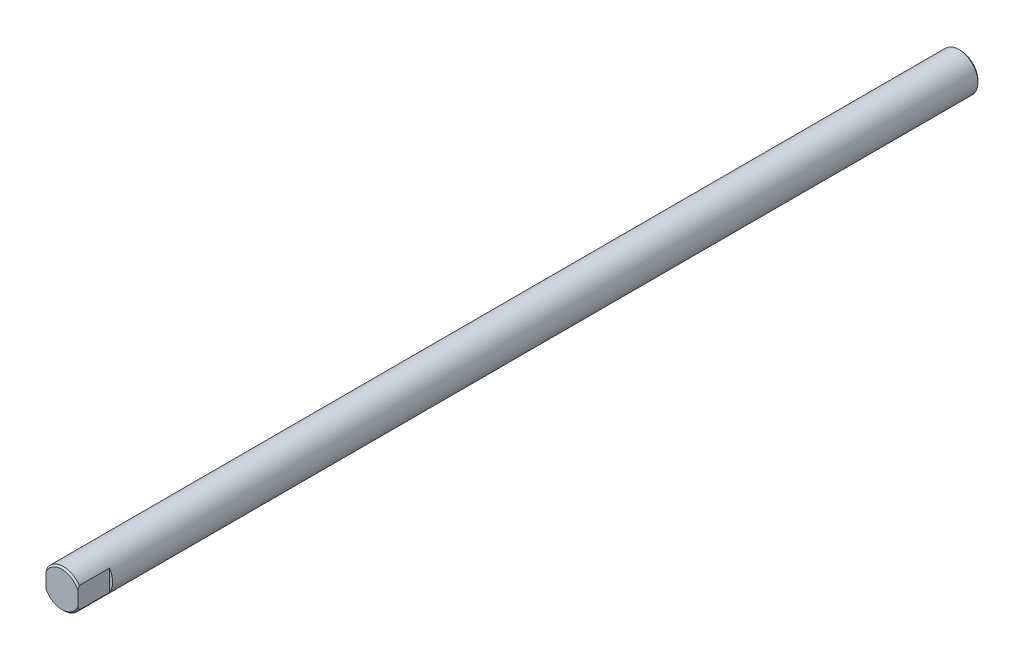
from build123d import *

# Parameters (mm, degrees)
ESQUISSE1_R               = 6
EXTRUSION1_DEPTH          = 283
CHANFREIN1_SIZE           = 0.5
TROU_TARAUD_M6X1_01_D     = 4.8
TROU_TARAUD_M6X1_01_DEPTH = 32
TROU_TARAUD_M6X1_01_TIP   = 1.442065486
ESQUISSE4_W               = 4.428574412
ESQUISSE4_H               = 11.631898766
ESQUISSE4_W_2             = 3.546534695
ESQUISSE4_H_2             = 12.109670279
ENL_V_MAT_EXTRU_1_DEPTH   = 10


with BuildPart() as part:
    # Esquisse1 → Extrusion1 (new body)
    with BuildSketch(Plane.XY):
        with Locations(Location((0, 0, 0), (0, 0, 213.557309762))):
            Circle(ESQUISSE1_R)
    extrude(amount=EXTRUSION1_DEPTH)

    # Chanfrein1
    chanfrein1_edges = [part.edges().sort_by_distance(p)[0] for p in [
        (5, 3.31662479, 0),
        (5, 3.31662479, 283),
    ]]
    chamfer(chanfrein1_edges, length=CHANFREIN1_SIZE)

    # Trou taraud_ M6x1.01
    with Locations(Plane(origin=(0, 0, 0), x_dir=(-1, 0, 0), z_dir=(0, 0, -1))):
        with Locations((0, 0)):
            Hole(TROU_TARAUD_M6X1_01_D / 2, depth=TROU_TARAUD_M6X1_01_DEPTH)
            with Locations((0, 0, -(TROU_TARAUD_M6X1_01_DEPTH + TROU_TARAUD_M6X1_01_TIP / 2))):  # 118° drill point
                Cone(0, TROU_TARAUD_M6X1_01_D / 2, TROU_TARAUD_M6X1_01_TIP, mode=Mode.SUBTRACT)

    # Esquisse4 → Enl_v. mat.-Extru.1 (cut)
    with BuildSketch(Plane.XY.offset(283)):
        with Locations((7.214287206, -0.192946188)):
            Rectangle(ESQUISSE4_W, ESQUISSE4_H)
        with Locations((-6.773267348, -0.156194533)):
            Rectangle(ESQUISSE4_W_2, ESQUISSE4_H_2)
    extrude(amount=-ENL_V_MAT_EXTRU_1_DEPTH, mode=Mode.SUBTRACT)


solid = part.part
